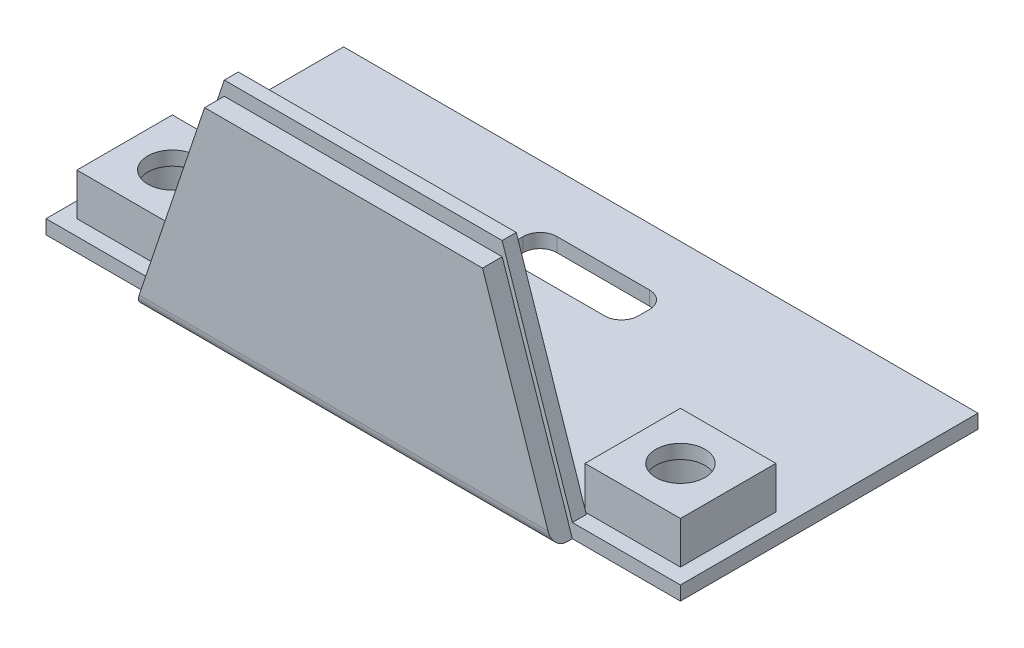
ISO-10303-21;
HEADER;
FILE_DESCRIPTION(('STEP AP214'),'2;1');
FILE_NAME('part.step','',(''),(''),'','','');
FILE_SCHEMA(('AUTOMOTIVE_DESIGN { 1 0 10303 214 1 1 1 1 }'));
ENDSEC;
DATA;
#1=APPLICATION_CONTEXT('core data for automotive mechanical design processes');
#2=APPLICATION_PROTOCOL_DEFINITION('international standard','automotive_design',2000,#1);
#3=PRODUCT_CONTEXT('',#1,'mechanical');
#4=PRODUCT('Part','Part','',(#3));
#5=PRODUCT_RELATED_PRODUCT_CATEGORY('part','',(#4));
#6=PRODUCT_DEFINITION_FORMATION('','',#4);
#7=PRODUCT_DEFINITION_CONTEXT('part definition',#1,'design');
#8=PRODUCT_DEFINITION('design','',#6,#7);
#9=PRODUCT_DEFINITION_SHAPE('','',#8);
#10=(LENGTH_UNIT() NAMED_UNIT(*) SI_UNIT(.MILLI.,.METRE.));
#11=(NAMED_UNIT(*) PLANE_ANGLE_UNIT() SI_UNIT($,.RADIAN.));
#12=(NAMED_UNIT(*) SI_UNIT($,.STERADIAN.) SOLID_ANGLE_UNIT());
#13=UNCERTAINTY_MEASURE_WITH_UNIT(LENGTH_MEASURE(1.E-05),#10,'distance_accuracy_value','');
#14=(GEOMETRIC_REPRESENTATION_CONTEXT(3) GLOBAL_UNCERTAINTY_ASSIGNED_CONTEXT((#13)) GLOBAL_UNIT_ASSIGNED_CONTEXT((#10,
#11,#12)) REPRESENTATION_CONTEXT('',''));
#15=CARTESIAN_POINT('',(0.,0.,0.));
#16=DIRECTION('',(0.,0.,1.));
#17=DIRECTION('',(1.,0.,0.));
#18=AXIS2_PLACEMENT_3D('',#15,#16,#17);
#19=CARTESIAN_POINT('',(0.,1.,0.));
#20=DIRECTION('',(0.,1.,0.));
#21=DIRECTION('',(0.,0.,1.));
#22=AXIS2_PLACEMENT_3D('',#19,#20,#21);
#23=PLANE('',#22);
#24=DIRECTION('',(0.,0.,-1.));
#25=VECTOR('',#24,1.);
#26=CARTESIAN_POINT('',(-4.5,1.,-5.3));
#27=LINE('',#26,#25);
#28=CARTESIAN_POINT('',(-4.5,1.,-4.5));
#29=VERTEX_POINT('',#28);
#30=CARTESIAN_POINT('',(-4.5,1.,-5.3));
#31=VERTEX_POINT('',#30);
#32=EDGE_CURVE('E240',#29,#31,#27,.T.);
#33=ORIENTED_EDGE('',*,*,#32,.T.);
#34=CARTESIAN_POINT('',(-3.3,1.,-5.3));
#35=DIRECTION('',(0.,1.,0.));
#36=DIRECTION('',(0.,0.,1.));
#37=AXIS2_PLACEMENT_3D('',#34,#35,#36);
#38=CIRCLE('',#37,1.2);
#39=CARTESIAN_POINT('',(-3.3,1.,-6.5));
#40=VERTEX_POINT('',#39);
#41=EDGE_CURVE('E226',#31,#40,#38,.F.);
#42=ORIENTED_EDGE('',*,*,#41,.T.);
#43=DIRECTION('',(1.,0.,0.));
#44=VECTOR('',#43,1.);
#45=CARTESIAN_POINT('',(-3.3,1.,-6.5));
#46=LINE('',#45,#44);
#47=CARTESIAN_POINT('',(3.3,1.,-6.5));
#48=VERTEX_POINT('',#47);
#49=EDGE_CURVE('E275',#40,#48,#46,.T.);
#50=ORIENTED_EDGE('',*,*,#49,.T.);
#51=CARTESIAN_POINT('',(3.3,1.,-5.3));
#52=DIRECTION('',(0.,1.,0.));
#53=DIRECTION('',(0.,0.,1.));
#54=AXIS2_PLACEMENT_3D('',#51,#52,#53);
#55=CIRCLE('',#54,1.2);
#56=CARTESIAN_POINT('',(4.5,1.,-5.3));
#57=VERTEX_POINT('',#56);
#58=EDGE_CURVE('E271',#48,#57,#55,.F.);
#59=ORIENTED_EDGE('',*,*,#58,.T.);
#60=DIRECTION('',(0.,0.,1.));
#61=VECTOR('',#60,1.);
#62=CARTESIAN_POINT('',(4.5,1.,-5.3));
#63=LINE('',#62,#61);
#64=CARTESIAN_POINT('',(4.5,1.,-4.5));
#65=VERTEX_POINT('',#64);
#66=EDGE_CURVE('E267',#57,#65,#63,.T.);
#67=ORIENTED_EDGE('',*,*,#66,.T.);
#68=CARTESIAN_POINT('',(3.3,1.,-4.5));
#69=DIRECTION('',(0.,1.,0.));
#70=DIRECTION('',(0.,0.,1.));
#71=AXIS2_PLACEMENT_3D('',#68,#69,#70);
#72=CIRCLE('',#71,1.2);
#73=CARTESIAN_POINT('',(3.3,1.,-3.3));
#74=VERTEX_POINT('',#73);
#75=EDGE_CURVE('E263',#65,#74,#72,.F.);
#76=ORIENTED_EDGE('',*,*,#75,.T.);
#77=DIRECTION('',(-1.,0.,0.));
#78=VECTOR('',#77,1.);
#79=CARTESIAN_POINT('',(-3.3,1.,-3.3));
#80=LINE('',#79,#78);
#81=CARTESIAN_POINT('',(-3.3,1.,-3.3));
#82=VERTEX_POINT('',#81);
#83=EDGE_CURVE('E260',#74,#82,#80,.T.);
#84=ORIENTED_EDGE('',*,*,#83,.T.);
#85=CARTESIAN_POINT('',(-3.3,1.,-4.5));
#86=DIRECTION('',(0.,1.,0.));
#87=DIRECTION('',(0.,0.,1.));
#88=AXIS2_PLACEMENT_3D('',#85,#86,#87);
#89=CIRCLE('',#88,1.2);
#90=EDGE_CURVE('E248',#82,#29,#89,.F.);
#91=ORIENTED_EDGE('',*,*,#90,.T.);
#92=EDGE_LOOP('',(#33,#42,#50,#59,#67,#76,#84,#91));
#93=FACE_BOUND('',#92,.T.);
#94=DIRECTION('',(0.,0.,-1.));
#95=VECTOR('',#94,1.);
#96=CARTESIAN_POINT('',(-21.5,1.,2.7));
#97=LINE('',#96,#95);
#98=CARTESIAN_POINT('',(-21.5,1.,9.5));
#99=VERTEX_POINT('',#98);
#100=CARTESIAN_POINT('',(-21.5,1.,2.7));
#101=VERTEX_POINT('',#100);
#102=EDGE_CURVE('E295',#99,#101,#97,.T.);
#103=ORIENTED_EDGE('',*,*,#102,.T.);
#104=DIRECTION('',(1.,0.,0.));
#105=VECTOR('',#104,1.);
#106=CARTESIAN_POINT('',(-14.7,1.,2.7));
#107=LINE('',#106,#105);
#108=CARTESIAN_POINT('',(-14.7,1.,2.7));
#109=VERTEX_POINT('',#108);
#110=EDGE_CURVE('E300',#101,#109,#107,.T.);
#111=ORIENTED_EDGE('',*,*,#110,.T.);
#112=DIRECTION('',(0.,0.,1.));
#113=VECTOR('',#112,1.);
#114=CARTESIAN_POINT('',(-14.7,1.,2.7));
#115=LINE('',#114,#113);
#116=CARTESIAN_POINT('',(-14.7,1.,9.5));
#117=VERTEX_POINT('',#116);
#118=EDGE_CURVE('E313',#109,#117,#115,.T.);
#119=ORIENTED_EDGE('',*,*,#118,.T.);
#120=DIRECTION('',(-1.,0.,0.));
#121=VECTOR('',#120,1.);
#122=CARTESIAN_POINT('',(-14.7,1.,9.5));
#123=LINE('',#122,#121);
#124=EDGE_CURVE('E311',#117,#99,#123,.T.);
#125=ORIENTED_EDGE('',*,*,#124,.T.);
#126=EDGE_LOOP('',(#103,#111,#119,#125));
#127=FACE_BOUND('',#126,.T.);
#128=DIRECTION('',(-1.,0.,0.));
#129=VECTOR('',#128,1.);
#130=CARTESIAN_POINT('',(14.7,1.,2.7));
#131=LINE('',#130,#129);
#132=CARTESIAN_POINT('',(21.5,1.,2.7));
#133=VERTEX_POINT('',#132);
#134=CARTESIAN_POINT('',(14.7,1.,2.7));
#135=VERTEX_POINT('',#134);
#136=EDGE_CURVE('E351',#133,#135,#131,.T.);
#137=ORIENTED_EDGE('',*,*,#136,.F.);
#138=DIRECTION('',(0.,0.,-1.));
#139=VECTOR('',#138,1.);
#140=CARTESIAN_POINT('',(21.5,1.,2.7));
#141=LINE('',#140,#139);
#142=CARTESIAN_POINT('',(21.5,1.,9.5));
#143=VERTEX_POINT('',#142);
#144=EDGE_CURVE('E337',#143,#133,#141,.T.);
#145=ORIENTED_EDGE('',*,*,#144,.F.);
#146=DIRECTION('',(1.,0.,0.));
#147=VECTOR('',#146,1.);
#148=CARTESIAN_POINT('',(14.7,1.,9.5));
#149=LINE('',#148,#147);
#150=CARTESIAN_POINT('',(14.7,1.,9.5));
#151=VERTEX_POINT('',#150);
#152=EDGE_CURVE('E342',#151,#143,#149,.T.);
#153=ORIENTED_EDGE('',*,*,#152,.F.);
#154=DIRECTION('',(0.,0.,1.));
#155=VECTOR('',#154,1.);
#156=CARTESIAN_POINT('',(14.7,1.,2.7));
#157=LINE('',#156,#155);
#158=EDGE_CURVE('E353',#135,#151,#157,.T.);
#159=ORIENTED_EDGE('',*,*,#158,.F.);
#160=EDGE_LOOP('',(#137,#145,#153,#159));
#161=FACE_BOUND('',#160,.T.);
#162=DIRECTION('',(-1.,0.,0.));
#163=VECTOR('',#162,1.);
#164=CARTESIAN_POINT('',(14.9,1.00000000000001,9.6));
#165=LINE('',#164,#163);
#166=CARTESIAN_POINT('',(14.9,1.00000000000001,9.6));
#167=VERTEX_POINT('',#166);
#168=CARTESIAN_POINT('',(-14.9,1.,9.6));
#169=VERTEX_POINT('',#168);
#170=EDGE_CURVE('E369',#167,#169,#165,.T.);
#171=ORIENTED_EDGE('',*,*,#170,.F.);
#172=DIRECTION('',(0.,0.,1.));
#173=VECTOR('',#172,1.);
#174=CARTESIAN_POINT('',(14.9,1.00000000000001,9.6));
#175=LINE('',#174,#173);
#176=CARTESIAN_POINT('',(14.9,1.00000000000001,10.6));
#177=VERTEX_POINT('',#176);
#178=EDGE_CURVE('E388',#167,#177,#175,.T.);
#179=ORIENTED_EDGE('',*,*,#178,.T.);
#180=DIRECTION('',(1.,0.,0.));
#181=VECTOR('',#180,1.);
#182=CARTESIAN_POINT('',(22.6,1.,10.6));
#183=LINE('',#182,#181);
#184=CARTESIAN_POINT('',(22.6,1.,10.6));
#185=VERTEX_POINT('',#184);
#186=EDGE_CURVE('E422',#177,#185,#183,.T.);
#187=ORIENTED_EDGE('',*,*,#186,.T.);
#188=DIRECTION('',(0.,0.,-1.));
#189=VECTOR('',#188,1.);
#190=CARTESIAN_POINT('',(22.6,1.,10.6));
#191=LINE('',#190,#189);
#192=CARTESIAN_POINT('',(22.6,1.,-10.6));
#193=VERTEX_POINT('',#192);
#194=EDGE_CURVE('E427',#185,#193,#191,.T.);
#195=ORIENTED_EDGE('',*,*,#194,.T.);
#196=DIRECTION('',(-1.,0.,0.));
#197=VECTOR('',#196,1.);
#198=CARTESIAN_POINT('',(22.6,1.,-10.6));
#199=LINE('',#198,#197);
#200=CARTESIAN_POINT('',(-22.6,1.,-10.6));
#201=VERTEX_POINT('',#200);
#202=EDGE_CURVE('E429',#193,#201,#199,.T.);
#203=ORIENTED_EDGE('',*,*,#202,.T.);
#204=DIRECTION('',(0.,0.,1.));
#205=VECTOR('',#204,1.);
#206=CARTESIAN_POINT('',(-22.6,1.,10.6));
#207=LINE('',#206,#205);
#208=CARTESIAN_POINT('',(-22.6,1.,10.6));
#209=VERTEX_POINT('',#208);
#210=EDGE_CURVE('E419',#201,#209,#207,.T.);
#211=ORIENTED_EDGE('',*,*,#210,.T.);
#212=CARTESIAN_POINT('',(-14.9,1.,10.6));
#213=VERTEX_POINT('',#212);
#214=EDGE_CURVE('E424',#209,#213,#183,.T.);
#215=ORIENTED_EDGE('',*,*,#214,.T.);
#216=DIRECTION('',(0.,0.,1.));
#217=VECTOR('',#216,1.);
#218=CARTESIAN_POINT('',(-14.9,1.,9.6));
#219=LINE('',#218,#217);
#220=EDGE_CURVE('E386',#169,#213,#219,.T.);
#221=ORIENTED_EDGE('',*,*,#220,.F.);
#222=EDGE_LOOP('',(#171,#179,#187,#195,#203,#211,#215,#221));
#223=FACE_BOUND('',#222,.T.);
#224=ADVANCED_FACE('F37',(#93,#127,#161,#223),#23,.T.);
#225=CARTESIAN_POINT('',(22.6,1.,10.6));
#226=DIRECTION('',(0.,0.,-1.));
#227=DIRECTION('',(-1.,0.,0.));
#228=AXIS2_PLACEMENT_3D('',#225,#226,#227);
#229=PLANE('',#228);
#230=DIRECTION('',(-0.318135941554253,-0.948045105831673,0.));
#231=VECTOR('',#230,1.);
#232=CARTESIAN_POINT('',(-9.9,14.9,10.6));
#233=LINE('',#232,#231);
#234=CARTESIAN_POINT('',(-9.9,14.9,10.6));
#235=VERTEX_POINT('',#234);
#236=CARTESIAN_POINT('',(-14.9,0.,10.6));
#237=VERTEX_POINT('',#236);
#238=EDGE_CURVE('E404',#235,#237,#233,.T.);
#239=ORIENTED_EDGE('',*,*,#238,.F.);
#240=DIRECTION('',(-1.,0.,0.));
#241=VECTOR('',#240,1.);
#242=CARTESIAN_POINT('',(9.9,14.9,10.6));
#243=LINE('',#242,#241);
#244=CARTESIAN_POINT('',(9.9,14.9,10.6));
#245=VERTEX_POINT('',#244);
#246=EDGE_CURVE('E395',#245,#235,#243,.T.);
#247=ORIENTED_EDGE('',*,*,#246,.F.);
#248=DIRECTION('',(-0.318135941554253,0.948045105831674,0.));
#249=VECTOR('',#248,1.);
#250=CARTESIAN_POINT('',(9.9,14.9,10.6));
#251=LINE('',#250,#249);
#252=CARTESIAN_POINT('',(14.9,0.,10.6));
#253=VERTEX_POINT('',#252);
#254=EDGE_CURVE('E391',#253,#245,#251,.T.);
#255=ORIENTED_EDGE('',*,*,#254,.F.);
#256=DIRECTION('',(1.,0.,0.));
#257=VECTOR('',#256,1.);
#258=CARTESIAN_POINT('',(22.6,0.,10.6));
#259=LINE('',#258,#257);
#260=CARTESIAN_POINT('',(22.6,0.,10.6));
#261=VERTEX_POINT('',#260);
#262=EDGE_CURVE('E434',#253,#261,#259,.T.);
#263=ORIENTED_EDGE('',*,*,#262,.T.);
#264=DIRECTION('',(0.,-1.,0.));
#265=VECTOR('',#264,1.);
#266=CARTESIAN_POINT('',(22.6,1.,10.6));
#267=LINE('',#266,#265);
#268=EDGE_CURVE('E446',#185,#261,#267,.T.);
#269=ORIENTED_EDGE('',*,*,#268,.F.);
#270=ORIENTED_EDGE('',*,*,#186,.F.);
#271=DIRECTION('',(0.318135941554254,-0.948045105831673,0.));
#272=VECTOR('',#271,1.);
#273=CARTESIAN_POINT('',(9.9,15.9,10.6));
#274=LINE('',#273,#272);
#275=CARTESIAN_POINT('',(9.9,15.9,10.6));
#276=VERTEX_POINT('',#275);
#277=EDGE_CURVE('E366',#276,#177,#274,.T.);
#278=ORIENTED_EDGE('',*,*,#277,.F.);
#279=DIRECTION('',(1.,0.,0.));
#280=VECTOR('',#279,1.);
#281=CARTESIAN_POINT('',(9.9,15.9,10.6));
#282=LINE('',#281,#280);
#283=CARTESIAN_POINT('',(-9.9,15.9,10.6));
#284=VERTEX_POINT('',#283);
#285=EDGE_CURVE('E370',#284,#276,#282,.T.);
#286=ORIENTED_EDGE('',*,*,#285,.F.);
#287=DIRECTION('',(0.318135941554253,0.948045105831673,0.));
#288=VECTOR('',#287,1.);
#289=CARTESIAN_POINT('',(-9.9,15.9,10.6));
#290=LINE('',#289,#288);
#291=EDGE_CURVE('E378',#213,#284,#290,.T.);
#292=ORIENTED_EDGE('',*,*,#291,.F.);
#293=ORIENTED_EDGE('',*,*,#214,.F.);
#294=DIRECTION('',(0.,-1.,0.));
#295=VECTOR('',#294,1.);
#296=CARTESIAN_POINT('',(-22.6,1.,10.6));
#297=LINE('',#296,#295);
#298=CARTESIAN_POINT('',(-22.6,0.,10.6));
#299=VERTEX_POINT('',#298);
#300=EDGE_CURVE('E408',#209,#299,#297,.T.);
#301=ORIENTED_EDGE('',*,*,#300,.T.);
#302=EDGE_CURVE('E435',#299,#237,#259,.T.);
#303=ORIENTED_EDGE('',*,*,#302,.T.);
#304=EDGE_LOOP('',(#239,#247,#255,#263,#269,#270,#278,#286,#292,#293,#301,#303));
#305=FACE_BOUND('',#304,.T.);
#306=ADVANCED_FACE('F482',(#305),#229,.F.);
#307=CARTESIAN_POINT('',(-22.6,1.,10.6));
#308=DIRECTION('',(1.,0.,0.));
#309=DIRECTION('',(0.,0.,-1.));
#310=AXIS2_PLACEMENT_3D('',#307,#308,#309);
#311=PLANE('',#310);
#312=DIRECTION('',(0.,0.,1.));
#313=VECTOR('',#312,1.);
#314=CARTESIAN_POINT('',(-22.6,0.,10.6));
#315=LINE('',#314,#313);
#316=CARTESIAN_POINT('',(-22.6,0.,-10.6));
#317=VERTEX_POINT('',#316);
#318=EDGE_CURVE('E418',#317,#299,#315,.T.);
#319=ORIENTED_EDGE('',*,*,#318,.T.);
#320=ORIENTED_EDGE('',*,*,#300,.F.);
#321=ORIENTED_EDGE('',*,*,#210,.F.);
#322=DIRECTION('',(0.,-1.,0.));
#323=VECTOR('',#322,1.);
#324=CARTESIAN_POINT('',(-22.6,1.,-10.6));
#325=LINE('',#324,#323);
#326=EDGE_CURVE('E431',#201,#317,#325,.T.);
#327=ORIENTED_EDGE('',*,*,#326,.T.);
#328=EDGE_LOOP('',(#319,#320,#321,#327));
#329=FACE_BOUND('',#328,.T.);
#330=ADVANCED_FACE('F489',(#329),#311,.F.);
#331=CARTESIAN_POINT('',(22.6,1.,10.6));
#332=DIRECTION('',(-1.,0.,0.));
#333=DIRECTION('',(0.,0.,1.));
#334=AXIS2_PLACEMENT_3D('',#331,#332,#333);
#335=PLANE('',#334);
#336=DIRECTION('',(0.,0.,-1.));
#337=VECTOR('',#336,1.);
#338=CARTESIAN_POINT('',(22.6,0.,10.6));
#339=LINE('',#338,#337);
#340=CARTESIAN_POINT('',(22.6,0.,-10.6));
#341=VERTEX_POINT('',#340);
#342=EDGE_CURVE('E438',#261,#341,#339,.T.);
#343=ORIENTED_EDGE('',*,*,#342,.T.);
#344=DIRECTION('',(0.,-1.,0.));
#345=VECTOR('',#344,1.);
#346=CARTESIAN_POINT('',(22.6,1.,-10.6));
#347=LINE('',#346,#345);
#348=EDGE_CURVE('E443',#193,#341,#347,.T.);
#349=ORIENTED_EDGE('',*,*,#348,.F.);
#350=ORIENTED_EDGE('',*,*,#194,.F.);
#351=ORIENTED_EDGE('',*,*,#268,.T.);
#352=EDGE_LOOP('',(#343,#349,#350,#351));
#353=FACE_BOUND('',#352,.T.);
#354=ADVANCED_FACE('F502',(#353),#335,.F.);
#355=CARTESIAN_POINT('',(22.6,1.,-10.6));
#356=DIRECTION('',(0.,0.,1.));
#357=DIRECTION('',(1.,0.,0.));
#358=AXIS2_PLACEMENT_3D('',#355,#356,#357);
#359=PLANE('',#358);
#360=DIRECTION('',(-1.,0.,0.));
#361=VECTOR('',#360,1.);
#362=CARTESIAN_POINT('',(22.6,0.,-10.6));
#363=LINE('',#362,#361);
#364=EDGE_CURVE('E423',#341,#317,#363,.T.);
#365=ORIENTED_EDGE('',*,*,#364,.T.);
#366=ORIENTED_EDGE('',*,*,#326,.F.);
#367=ORIENTED_EDGE('',*,*,#202,.F.);
#368=ORIENTED_EDGE('',*,*,#348,.T.);
#369=EDGE_LOOP('',(#365,#366,#367,#368));
#370=FACE_BOUND('',#369,.T.);
#371=ADVANCED_FACE('F498',(#370),#359,.F.);
#372=CARTESIAN_POINT('',(0.,0.,0.));
#373=DIRECTION('',(0.,1.,0.));
#374=DIRECTION('',(0.,0.,1.));
#375=AXIS2_PLACEMENT_3D('',#372,#373,#374);
#376=PLANE('',#375);
#377=CARTESIAN_POINT('',(-3.3,0.,-5.3));
#378=DIRECTION('',(0.,-1.,0.));
#379=DIRECTION('',(0.,0.,1.));
#380=AXIS2_PLACEMENT_3D('',#377,#378,#379);
#381=CIRCLE('',#380,1.2);
#382=CARTESIAN_POINT('',(-4.5,0.,-5.3));
#383=VERTEX_POINT('',#382);
#384=CARTESIAN_POINT('',(-3.3,0.,-6.5));
#385=VERTEX_POINT('',#384);
#386=EDGE_CURVE('E996',#383,#385,#381,.T.);
#387=ORIENTED_EDGE('',*,*,#386,.F.);
#388=DIRECTION('',(0.,0.,-1.));
#389=VECTOR('',#388,1.);
#390=CARTESIAN_POINT('',(-4.5,0.,-5.3));
#391=LINE('',#390,#389);
#392=CARTESIAN_POINT('',(-4.5,0.,-4.5));
#393=VERTEX_POINT('',#392);
#394=EDGE_CURVE('E243',#393,#383,#391,.T.);
#395=ORIENTED_EDGE('',*,*,#394,.F.);
#396=CARTESIAN_POINT('',(-3.3,0.,-4.5));
#397=DIRECTION('',(0.,-1.,0.));
#398=DIRECTION('',(0.,0.,1.));
#399=AXIS2_PLACEMENT_3D('',#396,#397,#398);
#400=CIRCLE('',#399,1.2);
#401=CARTESIAN_POINT('',(-3.3,0.,-3.3));
#402=VERTEX_POINT('',#401);
#403=EDGE_CURVE('E255',#402,#393,#400,.T.);
#404=ORIENTED_EDGE('',*,*,#403,.F.);
#405=DIRECTION('',(-1.,0.,0.));
#406=VECTOR('',#405,1.);
#407=CARTESIAN_POINT('',(-3.3,0.,-3.3));
#408=LINE('',#407,#406);
#409=CARTESIAN_POINT('',(3.3,0.,-3.3));
#410=VERTEX_POINT('',#409);
#411=EDGE_CURVE('E249',#410,#402,#408,.T.);
#412=ORIENTED_EDGE('',*,*,#411,.F.);
#413=CARTESIAN_POINT('',(3.3,0.,-4.5));
#414=DIRECTION('',(0.,-1.,0.));
#415=DIRECTION('',(0.,0.,1.));
#416=AXIS2_PLACEMENT_3D('',#413,#414,#415);
#417=CIRCLE('',#416,1.2);
#418=CARTESIAN_POINT('',(4.5,0.,-4.5));
#419=VERTEX_POINT('',#418);
#420=EDGE_CURVE('E251',#419,#410,#417,.T.);
#421=ORIENTED_EDGE('',*,*,#420,.F.);
#422=DIRECTION('',(0.,0.,1.));
#423=VECTOR('',#422,1.);
#424=CARTESIAN_POINT('',(4.5,0.,-5.3));
#425=LINE('',#424,#423);
#426=CARTESIAN_POINT('',(4.5,0.,-5.3));
#427=VERTEX_POINT('',#426);
#428=EDGE_CURVE('E1002',#427,#419,#425,.T.);
#429=ORIENTED_EDGE('',*,*,#428,.F.);
#430=CARTESIAN_POINT('',(3.3,0.,-5.3));
#431=DIRECTION('',(0.,-1.,0.));
#432=DIRECTION('',(0.,0.,-1.));
#433=AXIS2_PLACEMENT_3D('',#430,#431,#432);
#434=CIRCLE('',#433,1.2);
#435=CARTESIAN_POINT('',(3.3,0.,-6.5));
#436=VERTEX_POINT('',#435);
#437=EDGE_CURVE('E1000',#436,#427,#434,.T.);
#438=ORIENTED_EDGE('',*,*,#437,.F.);
#439=DIRECTION('',(1.,0.,0.));
#440=VECTOR('',#439,1.);
#441=CARTESIAN_POINT('',(-3.3,0.,-6.5));
#442=LINE('',#441,#440);
#443=EDGE_CURVE('E994',#385,#436,#442,.T.);
#444=ORIENTED_EDGE('',*,*,#443,.F.);
#445=EDGE_LOOP('',(#387,#395,#404,#412,#421,#429,#438,#444));
#446=FACE_BOUND('',#445,.T.);
#447=CARTESIAN_POINT('',(-18.1,0.,6.1));
#448=DIRECTION('',(0.,1.,0.));
#449=DIRECTION('',(0.,0.,1.));
#450=AXIS2_PLACEMENT_3D('',#447,#448,#449);
#451=CIRCLE('',#450,3.);
#452=CARTESIAN_POINT('',(-18.1,0.,9.09999999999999));
#453=VERTEX_POINT('',#452);
#454=EDGE_CURVE('E285',#453,#453,#451,.T.);
#455=ORIENTED_EDGE('',*,*,#454,.T.);
#456=EDGE_LOOP('',(#455));
#457=FACE_BOUND('',#456,.T.);
#458=CARTESIAN_POINT('',(18.1,0.,6.1));
#459=DIRECTION('',(0.,1.,0.));
#460=DIRECTION('',(0.,0.,1.));
#461=AXIS2_PLACEMENT_3D('',#458,#459,#460);
#462=CIRCLE('',#461,3.);
#463=CARTESIAN_POINT('',(18.1,0.,9.09999999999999));
#464=VERTEX_POINT('',#463);
#465=EDGE_CURVE('E327',#464,#464,#462,.F.);
#466=ORIENTED_EDGE('',*,*,#465,.F.);
#467=EDGE_LOOP('',(#466));
#468=FACE_BOUND('',#467,.T.);
#469=DIRECTION('',(0.,0.,-1.));
#470=VECTOR('',#469,1.);
#471=CARTESIAN_POINT('',(14.9,0.,12.));
#472=LINE('',#471,#470);
#473=CARTESIAN_POINT('',(14.9,0.,11.));
#474=VERTEX_POINT('',#473);
#475=EDGE_CURVE('E400',#474,#253,#472,.T.);
#476=ORIENTED_EDGE('',*,*,#475,.F.);
#477=DIRECTION('',(1.,0.,0.));
#478=VECTOR('',#477,1.);
#479=CARTESIAN_POINT('',(-14.9,0.,11.));
#480=LINE('',#479,#478);
#481=CARTESIAN_POINT('',(-14.9,0.,11.));
#482=VERTEX_POINT('',#481);
#483=EDGE_CURVE('E45',#474,#482,#480,.F.);
#484=ORIENTED_EDGE('',*,*,#483,.T.);
#485=DIRECTION('',(0.,0.,-1.));
#486=VECTOR('',#485,1.);
#487=CARTESIAN_POINT('',(-14.9,0.,12.));
#488=LINE('',#487,#486);
#489=EDGE_CURVE('E410',#482,#237,#488,.T.);
#490=ORIENTED_EDGE('',*,*,#489,.T.);
#491=ORIENTED_EDGE('',*,*,#302,.F.);
#492=ORIENTED_EDGE('',*,*,#318,.F.);
#493=ORIENTED_EDGE('',*,*,#364,.F.);
#494=ORIENTED_EDGE('',*,*,#342,.F.);
#495=ORIENTED_EDGE('',*,*,#262,.F.);
#496=EDGE_LOOP('',(#476,#484,#490,#491,#492,#493,#494,#495));
#497=FACE_BOUND('',#496,.T.);
#498=ADVANCED_FACE('F495',(#446,#457,#468,#497),#376,.F.);
#499=CARTESIAN_POINT('',(9.9,14.9,12.));
#500=DIRECTION('',(-0.948045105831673,-0.318135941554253,0.));
#501=DIRECTION('',(0.318135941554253,-0.948045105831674,0.));
#502=AXIS2_PLACEMENT_3D('',#499,#500,#501);
#503=PLANE('',#502);
#504=DIRECTION('',(-0.318135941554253,0.948045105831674,0.));
#505=VECTOR('',#504,1.);
#506=CARTESIAN_POINT('',(9.9,14.9,12.));
#507=LINE('',#506,#505);
#508=CARTESIAN_POINT('',(14.5644295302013,0.999999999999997,12.));
#509=VERTEX_POINT('',#508);
#510=CARTESIAN_POINT('',(9.9,14.9,12.));
#511=VERTEX_POINT('',#510);
#512=EDGE_CURVE('E392',#509,#511,#507,.T.);
#513=ORIENTED_EDGE('',*,*,#512,.F.);
#514=CARTESIAN_POINT('',(14.5644295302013,1.,11.));
#515=DIRECTION('',(-0.948045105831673,-0.318135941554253,0.));
#516=DIRECTION('',(-0.318135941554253,0.948045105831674,0.));
#517=AXIS2_PLACEMENT_3D('',#514,#515,#516);
#518=ELLIPSE('',#517,1.05480213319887,1.);
#519=EDGE_CURVE('E59',#509,#474,#518,.F.);
#520=ORIENTED_EDGE('',*,*,#519,.T.);
#521=ORIENTED_EDGE('',*,*,#475,.T.);
#522=ORIENTED_EDGE('',*,*,#254,.T.);
#523=DIRECTION('',(0.,0.,-1.));
#524=VECTOR('',#523,1.);
#525=CARTESIAN_POINT('',(9.9,14.9,12.));
#526=LINE('',#525,#524);
#527=EDGE_CURVE('E415',#511,#245,#526,.T.);
#528=ORIENTED_EDGE('',*,*,#527,.F.);
#529=EDGE_LOOP('',(#513,#520,#521,#522,#528));
#530=FACE_BOUND('',#529,.T.);
#531=ADVANCED_FACE('F465',(#530),#503,.F.);
#532=CARTESIAN_POINT('',(9.9,14.9,12.));
#533=DIRECTION('',(0.,-1.,0.));
#534=DIRECTION('',(0.,0.,-1.));
#535=AXIS2_PLACEMENT_3D('',#532,#533,#534);
#536=PLANE('',#535);
#537=ORIENTED_EDGE('',*,*,#246,.T.);
#538=DIRECTION('',(0.,0.,-1.));
#539=VECTOR('',#538,1.);
#540=CARTESIAN_POINT('',(-9.9,14.9,12.));
#541=LINE('',#540,#539);
#542=CARTESIAN_POINT('',(-9.9,14.9,12.));
#543=VERTEX_POINT('',#542);
#544=EDGE_CURVE('E412',#543,#235,#541,.T.);
#545=ORIENTED_EDGE('',*,*,#544,.F.);
#546=DIRECTION('',(-1.,0.,0.));
#547=VECTOR('',#546,1.);
#548=CARTESIAN_POINT('',(9.9,14.9,12.));
#549=LINE('',#548,#547);
#550=EDGE_CURVE('E394',#511,#543,#549,.T.);
#551=ORIENTED_EDGE('',*,*,#550,.F.);
#552=ORIENTED_EDGE('',*,*,#527,.T.);
#553=EDGE_LOOP('',(#537,#545,#551,#552));
#554=FACE_BOUND('',#553,.T.);
#555=ADVANCED_FACE('F469',(#554),#536,.F.);
#556=CARTESIAN_POINT('',(-9.9,14.9,12.));
#557=DIRECTION('',(0.948045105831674,-0.318135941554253,0.));
#558=DIRECTION('',(0.318135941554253,0.948045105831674,0.));
#559=AXIS2_PLACEMENT_3D('',#556,#557,#558);
#560=PLANE('',#559);
#561=ORIENTED_EDGE('',*,*,#489,.F.);
#562=CARTESIAN_POINT('',(-14.5644295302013,1.,11.));
#563=DIRECTION('',(0.948045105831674,-0.318135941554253,0.));
#564=DIRECTION('',(-0.318135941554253,-0.948045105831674,0.));
#565=AXIS2_PLACEMENT_3D('',#562,#563,#564);
#566=ELLIPSE('',#565,1.05480213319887,1.);
#567=CARTESIAN_POINT('',(-14.5644295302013,1.,12.));
#568=VERTEX_POINT('',#567);
#569=EDGE_CURVE('E11',#482,#568,#566,.F.);
#570=ORIENTED_EDGE('',*,*,#569,.T.);
#571=DIRECTION('',(-0.318135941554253,-0.948045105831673,0.));
#572=VECTOR('',#571,1.);
#573=CARTESIAN_POINT('',(-9.9,14.9,12.));
#574=LINE('',#573,#572);
#575=EDGE_CURVE('E397',#543,#568,#574,.T.);
#576=ORIENTED_EDGE('',*,*,#575,.F.);
#577=ORIENTED_EDGE('',*,*,#544,.T.);
#578=ORIENTED_EDGE('',*,*,#238,.T.);
#579=EDGE_LOOP('',(#561,#570,#576,#577,#578));
#580=FACE_BOUND('',#579,.T.);
#581=ADVANCED_FACE('F472',(#580),#560,.F.);
#582=CARTESIAN_POINT('',(0.,0.,12.));
#583=DIRECTION('',(0.,0.,1.));
#584=DIRECTION('',(1.,0.,0.));
#585=AXIS2_PLACEMENT_3D('',#582,#583,#584);
#586=PLANE('',#585);
#587=ORIENTED_EDGE('',*,*,#575,.T.);
#588=DIRECTION('',(1.,0.,0.));
#589=VECTOR('',#588,1.);
#590=CARTESIAN_POINT('',(14.9,1.,12.));
#591=LINE('',#590,#589);
#592=EDGE_CURVE('E407',#568,#509,#591,.T.);
#593=ORIENTED_EDGE('',*,*,#592,.T.);
#594=ORIENTED_EDGE('',*,*,#512,.T.);
#595=ORIENTED_EDGE('',*,*,#550,.T.);
#596=EDGE_LOOP('',(#587,#593,#594,#595));
#597=FACE_BOUND('',#596,.T.);
#598=ADVANCED_FACE('F459',(#597),#586,.T.);
#599=CARTESIAN_POINT('',(9.9,15.9,9.6));
#600=DIRECTION('',(-0.948045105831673,-0.318135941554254,0.));
#601=DIRECTION('',(0.318135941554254,-0.948045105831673,0.));
#602=AXIS2_PLACEMENT_3D('',#599,#600,#601);
#603=PLANE('',#602);
#604=ORIENTED_EDGE('',*,*,#277,.T.);
#605=ORIENTED_EDGE('',*,*,#178,.F.);
#606=DIRECTION('',(0.318135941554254,-0.948045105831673,0.));
#607=VECTOR('',#606,1.);
#608=CARTESIAN_POINT('',(9.9,15.9,9.6));
#609=LINE('',#608,#607);
#610=CARTESIAN_POINT('',(9.9,15.9,9.6));
#611=VERTEX_POINT('',#610);
#612=EDGE_CURVE('E367',#611,#167,#609,.T.);
#613=ORIENTED_EDGE('',*,*,#612,.F.);
#614=DIRECTION('',(0.,0.,1.));
#615=VECTOR('',#614,1.);
#616=CARTESIAN_POINT('',(9.9,15.9,9.6));
#617=LINE('',#616,#615);
#618=EDGE_CURVE('E376',#611,#276,#617,.T.);
#619=ORIENTED_EDGE('',*,*,#618,.T.);
#620=EDGE_LOOP('',(#604,#605,#613,#619));
#621=FACE_BOUND('',#620,.T.);
#622=ADVANCED_FACE('F531',(#621),#603,.F.);
#623=CARTESIAN_POINT('',(-9.9,15.9,9.6));
#624=DIRECTION('',(0.948045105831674,-0.318135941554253,0.));
#625=DIRECTION('',(0.318135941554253,0.948045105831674,0.));
#626=AXIS2_PLACEMENT_3D('',#623,#624,#625);
#627=PLANE('',#626);
#628=ORIENTED_EDGE('',*,*,#291,.T.);
#629=DIRECTION('',(0.,0.,1.));
#630=VECTOR('',#629,1.);
#631=CARTESIAN_POINT('',(-9.9,15.9,9.6));
#632=LINE('',#631,#630);
#633=CARTESIAN_POINT('',(-9.9,15.9,9.6));
#634=VERTEX_POINT('',#633);
#635=EDGE_CURVE('E383',#634,#284,#632,.T.);
#636=ORIENTED_EDGE('',*,*,#635,.F.);
#637=DIRECTION('',(0.318135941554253,0.948045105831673,0.));
#638=VECTOR('',#637,1.);
#639=CARTESIAN_POINT('',(-9.9,15.9,9.6));
#640=LINE('',#639,#638);
#641=EDGE_CURVE('E372',#169,#634,#640,.T.);
#642=ORIENTED_EDGE('',*,*,#641,.F.);
#643=ORIENTED_EDGE('',*,*,#220,.T.);
#644=EDGE_LOOP('',(#628,#636,#642,#643));
#645=FACE_BOUND('',#644,.T.);
#646=ADVANCED_FACE('F539',(#645),#627,.F.);
#647=CARTESIAN_POINT('',(9.9,15.9,9.6));
#648=DIRECTION('',(0.,-1.,0.));
#649=DIRECTION('',(1.,0.,0.));
#650=AXIS2_PLACEMENT_3D('',#647,#648,#649);
#651=PLANE('',#650);
#652=ORIENTED_EDGE('',*,*,#285,.T.);
#653=ORIENTED_EDGE('',*,*,#618,.F.);
#654=DIRECTION('',(1.,0.,0.));
#655=VECTOR('',#654,1.);
#656=CARTESIAN_POINT('',(9.9,15.9,9.6));
#657=LINE('',#656,#655);
#658=EDGE_CURVE('E374',#634,#611,#657,.T.);
#659=ORIENTED_EDGE('',*,*,#658,.F.);
#660=ORIENTED_EDGE('',*,*,#635,.T.);
#661=EDGE_LOOP('',(#652,#653,#659,#660));
#662=FACE_BOUND('',#661,.T.);
#663=ADVANCED_FACE('F535',(#662),#651,.F.);
#664=CARTESIAN_POINT('',(0.,0.,9.59999999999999));
#665=DIRECTION('',(0.,0.,-1.));
#666=DIRECTION('',(-1.,0.,0.));
#667=AXIS2_PLACEMENT_3D('',#664,#665,#666);
#668=PLANE('',#667);
#669=ORIENTED_EDGE('',*,*,#612,.T.);
#670=ORIENTED_EDGE('',*,*,#170,.T.);
#671=ORIENTED_EDGE('',*,*,#641,.T.);
#672=ORIENTED_EDGE('',*,*,#658,.T.);
#673=EDGE_LOOP('',(#669,#670,#671,#672));
#674=FACE_BOUND('',#673,.T.);
#675=ADVANCED_FACE('F541',(#674),#668,.T.);
#676=CARTESIAN_POINT('',(0.,4.,0.));
#677=DIRECTION('',(0.,1.,0.));
#678=DIRECTION('',(0.,0.,1.));
#679=AXIS2_PLACEMENT_3D('',#676,#677,#678);
#680=PLANE('',#679);
#681=DIRECTION('',(0.,0.,-1.));
#682=VECTOR('',#681,1.);
#683=CARTESIAN_POINT('',(21.5,4.,2.7));
#684=LINE('',#683,#682);
#685=CARTESIAN_POINT('',(21.5,4.,9.5));
#686=VERTEX_POINT('',#685);
#687=CARTESIAN_POINT('',(21.5,4.,2.7));
#688=VERTEX_POINT('',#687);
#689=EDGE_CURVE('E338',#686,#688,#684,.T.);
#690=ORIENTED_EDGE('',*,*,#689,.T.);
#691=DIRECTION('',(-1.,0.,0.));
#692=VECTOR('',#691,1.);
#693=CARTESIAN_POINT('',(14.7,4.,2.7));
#694=LINE('',#693,#692);
#695=CARTESIAN_POINT('',(14.7,4.,2.7));
#696=VERTEX_POINT('',#695);
#697=EDGE_CURVE('E341',#688,#696,#694,.T.);
#698=ORIENTED_EDGE('',*,*,#697,.T.);
#699=DIRECTION('',(0.,0.,1.));
#700=VECTOR('',#699,1.);
#701=CARTESIAN_POINT('',(14.7,4.,2.7));
#702=LINE('',#701,#700);
#703=CARTESIAN_POINT('',(14.7,4.,9.5));
#704=VERTEX_POINT('',#703);
#705=EDGE_CURVE('E344',#696,#704,#702,.T.);
#706=ORIENTED_EDGE('',*,*,#705,.T.);
#707=DIRECTION('',(1.,0.,0.));
#708=VECTOR('',#707,1.);
#709=CARTESIAN_POINT('',(14.7,4.,9.5));
#710=LINE('',#709,#708);
#711=EDGE_CURVE('E346',#704,#686,#710,.T.);
#712=ORIENTED_EDGE('',*,*,#711,.T.);
#713=EDGE_LOOP('',(#690,#698,#706,#712));
#714=FACE_BOUND('',#713,.T.);
#715=CARTESIAN_POINT('',(18.1,4.,6.1));
#716=DIRECTION('',(0.,1.,0.));
#717=DIRECTION('',(0.,0.,1.));
#718=AXIS2_PLACEMENT_3D('',#715,#716,#717);
#719=CIRCLE('',#718,1.75);
#720=CARTESIAN_POINT('',(18.1,4.,7.85));
#721=VERTEX_POINT('',#720);
#722=EDGE_CURVE('E334',#721,#721,#719,.T.);
#723=ORIENTED_EDGE('',*,*,#722,.F.);
#724=EDGE_LOOP('',(#723));
#725=FACE_BOUND('',#724,.T.);
#726=ADVANCED_FACE('F543',(#714,#725),#680,.T.);
#727=CARTESIAN_POINT('',(21.5,4.,2.7));
#728=DIRECTION('',(-1.,0.,0.));
#729=DIRECTION('',(0.,0.,1.));
#730=AXIS2_PLACEMENT_3D('',#727,#728,#729);
#731=PLANE('',#730);
#732=ORIENTED_EDGE('',*,*,#144,.T.);
#733=DIRECTION('',(0.,-1.,0.));
#734=VECTOR('',#733,1.);
#735=CARTESIAN_POINT('',(21.5,4.,2.7));
#736=LINE('',#735,#734);
#737=EDGE_CURVE('E364',#688,#133,#736,.T.);
#738=ORIENTED_EDGE('',*,*,#737,.F.);
#739=ORIENTED_EDGE('',*,*,#689,.F.);
#740=DIRECTION('',(0.,-1.,0.));
#741=VECTOR('',#740,1.);
#742=CARTESIAN_POINT('',(21.5,4.,9.5));
#743=LINE('',#742,#741);
#744=EDGE_CURVE('E348',#686,#143,#743,.T.);
#745=ORIENTED_EDGE('',*,*,#744,.T.);
#746=EDGE_LOOP('',(#732,#738,#739,#745));
#747=FACE_BOUND('',#746,.T.);
#748=ADVANCED_FACE('F549',(#747),#731,.F.);
#749=CARTESIAN_POINT('',(14.7,4.,2.7));
#750=DIRECTION('',(0.,0.,1.));
#751=DIRECTION('',(1.,0.,0.));
#752=AXIS2_PLACEMENT_3D('',#749,#750,#751);
#753=PLANE('',#752);
#754=ORIENTED_EDGE('',*,*,#136,.T.);
#755=DIRECTION('',(0.,-1.,0.));
#756=VECTOR('',#755,1.);
#757=CARTESIAN_POINT('',(14.7,4.,2.7));
#758=LINE('',#757,#756);
#759=EDGE_CURVE('E361',#696,#135,#758,.T.);
#760=ORIENTED_EDGE('',*,*,#759,.F.);
#761=ORIENTED_EDGE('',*,*,#697,.F.);
#762=ORIENTED_EDGE('',*,*,#737,.T.);
#763=EDGE_LOOP('',(#754,#760,#761,#762));
#764=FACE_BOUND('',#763,.T.);
#765=ADVANCED_FACE('F804',(#764),#753,.F.);
#766=CARTESIAN_POINT('',(14.7,4.,2.7));
#767=DIRECTION('',(1.,0.,0.));
#768=DIRECTION('',(0.,0.,-1.));
#769=AXIS2_PLACEMENT_3D('',#766,#767,#768);
#770=PLANE('',#769);
#771=ORIENTED_EDGE('',*,*,#158,.T.);
#772=DIRECTION('',(0.,-1.,0.));
#773=VECTOR('',#772,1.);
#774=CARTESIAN_POINT('',(14.7,4.,9.5));
#775=LINE('',#774,#773);
#776=EDGE_CURVE('E359',#704,#151,#775,.T.);
#777=ORIENTED_EDGE('',*,*,#776,.F.);
#778=ORIENTED_EDGE('',*,*,#705,.F.);
#779=ORIENTED_EDGE('',*,*,#759,.T.);
#780=EDGE_LOOP('',(#771,#777,#778,#779));
#781=FACE_BOUND('',#780,.T.);
#782=ADVANCED_FACE('F793',(#781),#770,.F.);
#783=CARTESIAN_POINT('',(14.7,4.,9.5));
#784=DIRECTION('',(0.,0.,-1.));
#785=DIRECTION('',(-1.,0.,0.));
#786=AXIS2_PLACEMENT_3D('',#783,#784,#785);
#787=PLANE('',#786);
#788=ORIENTED_EDGE('',*,*,#152,.T.);
#789=ORIENTED_EDGE('',*,*,#744,.F.);
#790=ORIENTED_EDGE('',*,*,#711,.F.);
#791=ORIENTED_EDGE('',*,*,#776,.T.);
#792=EDGE_LOOP('',(#788,#789,#790,#791));
#793=FACE_BOUND('',#792,.T.);
#794=ADVANCED_FACE('F782',(#793),#787,.F.);
#795=CARTESIAN_POINT('',(18.1,4.,6.1));
#796=DIRECTION('',(0.,-1.,0.));
#797=DIRECTION('',(0.,0.,-1.));
#798=AXIS2_PLACEMENT_3D('',#795,#796,#797);
#799=CYLINDRICAL_SURFACE('',#798,1.75);
#800=CARTESIAN_POINT('',(18.1,3.,6.1));
#801=DIRECTION('',(0.,1.,0.));
#802=DIRECTION('',(0.,0.,1.));
#803=AXIS2_PLACEMENT_3D('',#800,#801,#802);
#804=CIRCLE('',#803,1.75);
#805=CARTESIAN_POINT('',(18.1,3.,7.85));
#806=VERTEX_POINT('',#805);
#807=EDGE_CURVE('E333',#806,#806,#804,.T.);
#808=ORIENTED_EDGE('',*,*,#807,.F.);
#809=EDGE_LOOP('',(#808));
#810=FACE_BOUND('',#809,.T.);
#811=ORIENTED_EDGE('',*,*,#722,.T.);
#812=EDGE_LOOP('',(#811));
#813=FACE_BOUND('',#812,.T.);
#814=ADVANCED_FACE('F771',(#810,#813),#799,.F.);
#815=CARTESIAN_POINT('',(18.1,3.,6.1));
#816=DIRECTION('',(0.,-1.,0.));
#817=DIRECTION('',(0.,0.,-1.));
#818=AXIS2_PLACEMENT_3D('',#815,#816,#817);
#819=CYLINDRICAL_SURFACE('',#818,3.);
#820=CARTESIAN_POINT('',(18.1,3.,6.1));
#821=DIRECTION('',(0.,1.,0.));
#822=DIRECTION('',(0.,0.,1.));
#823=AXIS2_PLACEMENT_3D('',#820,#821,#822);
#824=CIRCLE('',#823,3.);
#825=CARTESIAN_POINT('',(18.1,3.,9.09999999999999));
#826=VERTEX_POINT('',#825);
#827=EDGE_CURVE('E330',#826,#826,#824,.T.);
#828=ORIENTED_EDGE('',*,*,#827,.T.);
#829=EDGE_LOOP('',(#828));
#830=FACE_BOUND('',#829,.T.);
#831=ORIENTED_EDGE('',*,*,#465,.T.);
#832=EDGE_LOOP('',(#831));
#833=FACE_BOUND('',#832,.T.);
#834=ADVANCED_FACE('F760',(#830,#833),#819,.F.);
#835=CARTESIAN_POINT('',(18.1,3.,6.1));
#836=DIRECTION('',(0.,1.,0.));
#837=DIRECTION('',(0.,0.,1.));
#838=AXIS2_PLACEMENT_3D('',#835,#836,#837);
#839=PLANE('',#838);
#840=ORIENTED_EDGE('',*,*,#807,.T.);
#841=EDGE_LOOP('',(#840));
#842=FACE_BOUND('',#841,.T.);
#843=ORIENTED_EDGE('',*,*,#827,.F.);
#844=EDGE_LOOP('',(#843));
#845=FACE_BOUND('',#844,.T.);
#846=ADVANCED_FACE('F749',(#842,#845),#839,.F.);
#847=CARTESIAN_POINT('',(-21.5,4.,2.7));
#848=DIRECTION('',(-1.,0.,0.));
#849=DIRECTION('',(0.,0.,1.));
#850=AXIS2_PLACEMENT_3D('',#847,#848,#849);
#851=PLANE('',#850);
#852=ORIENTED_EDGE('',*,*,#102,.F.);
#853=DIRECTION('',(0.,-1.,0.));
#854=VECTOR('',#853,1.);
#855=CARTESIAN_POINT('',(-21.5,4.,9.5));
#856=LINE('',#855,#854);
#857=CARTESIAN_POINT('',(-21.5,4.,9.5));
#858=VERTEX_POINT('',#857);
#859=EDGE_CURVE('E324',#858,#99,#856,.T.);
#860=ORIENTED_EDGE('',*,*,#859,.F.);
#861=DIRECTION('',(0.,0.,-1.));
#862=VECTOR('',#861,1.);
#863=CARTESIAN_POINT('',(-21.5,4.,2.7));
#864=LINE('',#863,#862);
#865=CARTESIAN_POINT('',(-21.5,4.,2.7));
#866=VERTEX_POINT('',#865);
#867=EDGE_CURVE('E296',#858,#866,#864,.T.);
#868=ORIENTED_EDGE('',*,*,#867,.T.);
#869=DIRECTION('',(0.,-1.,0.));
#870=VECTOR('',#869,1.);
#871=CARTESIAN_POINT('',(-21.5,4.,2.7));
#872=LINE('',#871,#870);
#873=EDGE_CURVE('E309',#866,#101,#872,.T.);
#874=ORIENTED_EDGE('',*,*,#873,.T.);
#875=EDGE_LOOP('',(#852,#860,#868,#874));
#876=FACE_BOUND('',#875,.T.);
#877=ADVANCED_FACE('F738',(#876),#851,.T.);
#878=CARTESIAN_POINT('',(-14.7,4.,9.5));
#879=DIRECTION('',(0.,0.,1.));
#880=DIRECTION('',(1.,0.,0.));
#881=AXIS2_PLACEMENT_3D('',#878,#879,#880);
#882=PLANE('',#881);
#883=ORIENTED_EDGE('',*,*,#124,.F.);
#884=DIRECTION('',(0.,-1.,0.));
#885=VECTOR('',#884,1.);
#886=CARTESIAN_POINT('',(-14.7,4.,9.5));
#887=LINE('',#886,#885);
#888=CARTESIAN_POINT('',(-14.7,4.,9.5));
#889=VERTEX_POINT('',#888);
#890=EDGE_CURVE('E321',#889,#117,#887,.T.);
#891=ORIENTED_EDGE('',*,*,#890,.F.);
#892=DIRECTION('',(-1.,0.,0.));
#893=VECTOR('',#892,1.);
#894=CARTESIAN_POINT('',(-14.7,4.,9.5));
#895=LINE('',#894,#893);
#896=EDGE_CURVE('E299',#889,#858,#895,.T.);
#897=ORIENTED_EDGE('',*,*,#896,.T.);
#898=ORIENTED_EDGE('',*,*,#859,.T.);
#899=EDGE_LOOP('',(#883,#891,#897,#898));
#900=FACE_BOUND('',#899,.T.);
#901=ADVANCED_FACE('F727',(#900),#882,.T.);
#902=CARTESIAN_POINT('',(-14.7,4.,2.7));
#903=DIRECTION('',(1.,0.,0.));
#904=DIRECTION('',(0.,0.,-1.));
#905=AXIS2_PLACEMENT_3D('',#902,#903,#904);
#906=PLANE('',#905);
#907=ORIENTED_EDGE('',*,*,#118,.F.);
#908=DIRECTION('',(0.,-1.,0.));
#909=VECTOR('',#908,1.);
#910=CARTESIAN_POINT('',(-14.7,4.,2.7));
#911=LINE('',#910,#909);
#912=CARTESIAN_POINT('',(-14.7,4.,2.7));
#913=VERTEX_POINT('',#912);
#914=EDGE_CURVE('E318',#913,#109,#911,.T.);
#915=ORIENTED_EDGE('',*,*,#914,.F.);
#916=DIRECTION('',(0.,0.,1.));
#917=VECTOR('',#916,1.);
#918=CARTESIAN_POINT('',(-14.7,4.,2.7));
#919=LINE('',#918,#917);
#920=EDGE_CURVE('E303',#913,#889,#919,.T.);
#921=ORIENTED_EDGE('',*,*,#920,.T.);
#922=ORIENTED_EDGE('',*,*,#890,.T.);
#923=EDGE_LOOP('',(#907,#915,#921,#922));
#924=FACE_BOUND('',#923,.T.);
#925=ADVANCED_FACE('F716',(#924),#906,.T.);
#926=CARTESIAN_POINT('',(-14.7,4.,2.7));
#927=DIRECTION('',(0.,0.,-1.));
#928=DIRECTION('',(-1.,0.,0.));
#929=AXIS2_PLACEMENT_3D('',#926,#927,#928);
#930=PLANE('',#929);
#931=ORIENTED_EDGE('',*,*,#110,.F.);
#932=ORIENTED_EDGE('',*,*,#873,.F.);
#933=DIRECTION('',(1.,0.,0.));
#934=VECTOR('',#933,1.);
#935=CARTESIAN_POINT('',(-14.7,4.,2.7));
#936=LINE('',#935,#934);
#937=EDGE_CURVE('E306',#866,#913,#936,.T.);
#938=ORIENTED_EDGE('',*,*,#937,.T.);
#939=ORIENTED_EDGE('',*,*,#914,.T.);
#940=EDGE_LOOP('',(#931,#932,#938,#939));
#941=FACE_BOUND('',#940,.T.);
#942=ADVANCED_FACE('F705',(#941),#930,.T.);
#943=CARTESIAN_POINT('',(0.,4.,0.));
#944=DIRECTION('',(0.,1.,0.));
#945=DIRECTION('',(0.,0.,1.));
#946=AXIS2_PLACEMENT_3D('',#943,#944,#945);
#947=PLANE('',#946);
#948=CARTESIAN_POINT('',(-18.1,4.,6.1));
#949=DIRECTION('',(0.,-1.,0.));
#950=DIRECTION('',(0.,0.,1.));
#951=AXIS2_PLACEMENT_3D('',#948,#949,#950);
#952=CIRCLE('',#951,1.75);
#953=CARTESIAN_POINT('',(-18.1,4.,7.85));
#954=VERTEX_POINT('',#953);
#955=EDGE_CURVE('E292',#954,#954,#952,.T.);
#956=ORIENTED_EDGE('',*,*,#955,.T.);
#957=EDGE_LOOP('',(#956));
#958=FACE_BOUND('',#957,.T.);
#959=ORIENTED_EDGE('',*,*,#867,.F.);
#960=ORIENTED_EDGE('',*,*,#896,.F.);
#961=ORIENTED_EDGE('',*,*,#920,.F.);
#962=ORIENTED_EDGE('',*,*,#937,.F.);
#963=EDGE_LOOP('',(#959,#960,#961,#962));
#964=FACE_BOUND('',#963,.T.);
#965=ADVANCED_FACE('F694',(#958,#964),#947,.T.);
#966=CARTESIAN_POINT('',(-18.1,4.,6.1));
#967=DIRECTION('',(0.,-1.,0.));
#968=DIRECTION('',(0.,0.,-1.));
#969=AXIS2_PLACEMENT_3D('',#966,#967,#968);
#970=CYLINDRICAL_SURFACE('',#969,1.75);
#971=CARTESIAN_POINT('',(-18.1,3.,6.1));
#972=DIRECTION('',(0.,1.,0.));
#973=DIRECTION('',(0.,0.,1.));
#974=AXIS2_PLACEMENT_3D('',#971,#972,#973);
#975=CIRCLE('',#974,1.75);
#976=CARTESIAN_POINT('',(-18.1,3.,7.85));
#977=VERTEX_POINT('',#976);
#978=EDGE_CURVE('E291',#977,#977,#975,.F.);
#979=ORIENTED_EDGE('',*,*,#978,.T.);
#980=EDGE_LOOP('',(#979));
#981=FACE_BOUND('',#980,.T.);
#982=ORIENTED_EDGE('',*,*,#955,.F.);
#983=EDGE_LOOP('',(#982));
#984=FACE_BOUND('',#983,.T.);
#985=ADVANCED_FACE('F683',(#981,#984),#970,.F.);
#986=CARTESIAN_POINT('',(-18.1,3.,6.1));
#987=DIRECTION('',(0.,1.,0.));
#988=DIRECTION('',(0.,0.,1.));
#989=AXIS2_PLACEMENT_3D('',#986,#987,#988);
#990=PLANE('',#989);
#991=CARTESIAN_POINT('',(-18.1,3.,6.1));
#992=DIRECTION('',(0.,-1.,0.));
#993=DIRECTION('',(0.,0.,1.));
#994=AXIS2_PLACEMENT_3D('',#991,#992,#993);
#995=CIRCLE('',#994,3.);
#996=CARTESIAN_POINT('',(-18.1,3.,9.09999999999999));
#997=VERTEX_POINT('',#996);
#998=EDGE_CURVE('E288',#997,#997,#995,.T.);
#999=ORIENTED_EDGE('',*,*,#998,.T.);
#1000=EDGE_LOOP('',(#999));
#1001=FACE_BOUND('',#1000,.T.);
#1002=ORIENTED_EDGE('',*,*,#978,.F.);
#1003=EDGE_LOOP('',(#1002));
#1004=FACE_BOUND('',#1003,.T.);
#1005=ADVANCED_FACE('F672',(#1001,#1004),#990,.F.);
#1006=CARTESIAN_POINT('',(-18.1,3.,6.1));
#1007=DIRECTION('',(0.,-1.,0.));
#1008=DIRECTION('',(0.,0.,-1.));
#1009=AXIS2_PLACEMENT_3D('',#1006,#1007,#1008);
#1010=CYLINDRICAL_SURFACE('',#1009,3.);
#1011=ORIENTED_EDGE('',*,*,#998,.F.);
#1012=EDGE_LOOP('',(#1011));
#1013=FACE_BOUND('',#1012,.T.);
#1014=ORIENTED_EDGE('',*,*,#454,.F.);
#1015=EDGE_LOOP('',(#1014));
#1016=FACE_BOUND('',#1015,.T.);
#1017=ADVANCED_FACE('F663',(#1013,#1016),#1010,.F.);
#1018=CARTESIAN_POINT('',(-4.5,10.5519631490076,-5.3));
#1019=DIRECTION('',(-1.,0.,0.));
#1020=DIRECTION('',(0.,0.,1.));
#1021=AXIS2_PLACEMENT_3D('',#1018,#1019,#1020);
#1022=PLANE('',#1021);
#1023=DIRECTION('',(0.,-1.,0.));
#1024=VECTOR('',#1023,1.);
#1025=CARTESIAN_POINT('',(-4.5,10.5519631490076,-4.5));
#1026=LINE('',#1025,#1024);
#1027=EDGE_CURVE('E258',#29,#393,#1026,.T.);
#1028=ORIENTED_EDGE('',*,*,#1027,.T.);
#1029=ORIENTED_EDGE('',*,*,#394,.T.);
#1030=DIRECTION('',(0.,-1.,0.));
#1031=VECTOR('',#1030,1.);
#1032=CARTESIAN_POINT('',(-4.5,10.5519631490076,-5.3));
#1033=LINE('',#1032,#1031);
#1034=EDGE_CURVE('E230',#31,#383,#1033,.T.);
#1035=ORIENTED_EDGE('',*,*,#1034,.F.);
#1036=ORIENTED_EDGE('',*,*,#32,.F.);
#1037=EDGE_LOOP('',(#1028,#1029,#1035,#1036));
#1038=FACE_BOUND('',#1037,.T.);
#1039=ADVANCED_FACE('F239',(#1038),#1022,.F.);
#1040=CARTESIAN_POINT('',(-3.3,10.5519631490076,-5.3));
#1041=DIRECTION('',(0.,-1.,0.));
#1042=DIRECTION('',(0.,0.,-1.));
#1043=AXIS2_PLACEMENT_3D('',#1040,#1041,#1042);
#1044=CYLINDRICAL_SURFACE('',#1043,1.2);
#1045=ORIENTED_EDGE('',*,*,#1034,.T.);
#1046=ORIENTED_EDGE('',*,*,#386,.T.);
#1047=DIRECTION('',(0.,-1.,0.));
#1048=VECTOR('',#1047,1.);
#1049=CARTESIAN_POINT('',(-3.3,10.5519631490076,-6.5));
#1050=LINE('',#1049,#1048);
#1051=EDGE_CURVE('E232',#40,#385,#1050,.T.);
#1052=ORIENTED_EDGE('',*,*,#1051,.F.);
#1053=ORIENTED_EDGE('',*,*,#41,.F.);
#1054=EDGE_LOOP('',(#1045,#1046,#1052,#1053));
#1055=FACE_BOUND('',#1054,.T.);
#1056=ADVANCED_FACE('F228',(#1055),#1044,.F.);
#1057=CARTESIAN_POINT('',(-3.3,10.5519631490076,-6.5));
#1058=DIRECTION('',(0.,0.,-1.));
#1059=DIRECTION('',(-1.,0.,0.));
#1060=AXIS2_PLACEMENT_3D('',#1057,#1058,#1059);
#1061=PLANE('',#1060);
#1062=ORIENTED_EDGE('',*,*,#1051,.T.);
#1063=ORIENTED_EDGE('',*,*,#443,.T.);
#1064=DIRECTION('',(0.,-1.,0.));
#1065=VECTOR('',#1064,1.);
#1066=CARTESIAN_POINT('',(3.3,10.5519631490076,-6.5));
#1067=LINE('',#1066,#1065);
#1068=EDGE_CURVE('E274',#48,#436,#1067,.T.);
#1069=ORIENTED_EDGE('',*,*,#1068,.F.);
#1070=ORIENTED_EDGE('',*,*,#49,.F.);
#1071=EDGE_LOOP('',(#1062,#1063,#1069,#1070));
#1072=FACE_BOUND('',#1071,.T.);
#1073=ADVANCED_FACE('F634',(#1072),#1061,.F.);
#1074=CARTESIAN_POINT('',(3.3,10.5519631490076,-5.3));
#1075=DIRECTION('',(0.,-1.,0.));
#1076=DIRECTION('',(0.,0.,-1.));
#1077=AXIS2_PLACEMENT_3D('',#1074,#1075,#1076);
#1078=CYLINDRICAL_SURFACE('',#1077,1.2);
#1079=ORIENTED_EDGE('',*,*,#1068,.T.);
#1080=ORIENTED_EDGE('',*,*,#437,.T.);
#1081=DIRECTION('',(0.,-1.,0.));
#1082=VECTOR('',#1081,1.);
#1083=CARTESIAN_POINT('',(4.5,10.5519631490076,-5.3));
#1084=LINE('',#1083,#1082);
#1085=EDGE_CURVE('E270',#57,#427,#1084,.T.);
#1086=ORIENTED_EDGE('',*,*,#1085,.F.);
#1087=ORIENTED_EDGE('',*,*,#58,.F.);
#1088=EDGE_LOOP('',(#1079,#1080,#1086,#1087));
#1089=FACE_BOUND('',#1088,.T.);
#1090=ADVANCED_FACE('F623',(#1089),#1078,.F.);
#1091=CARTESIAN_POINT('',(4.5,10.5519631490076,-5.3));
#1092=DIRECTION('',(1.,0.,0.));
#1093=DIRECTION('',(0.,0.,-1.));
#1094=AXIS2_PLACEMENT_3D('',#1091,#1092,#1093);
#1095=PLANE('',#1094);
#1096=ORIENTED_EDGE('',*,*,#1085,.T.);
#1097=ORIENTED_EDGE('',*,*,#428,.T.);
#1098=DIRECTION('',(0.,-1.,0.));
#1099=VECTOR('',#1098,1.);
#1100=CARTESIAN_POINT('',(4.5,10.5519631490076,-4.5));
#1101=LINE('',#1100,#1099);
#1102=EDGE_CURVE('E266',#65,#419,#1101,.T.);
#1103=ORIENTED_EDGE('',*,*,#1102,.F.);
#1104=ORIENTED_EDGE('',*,*,#66,.F.);
#1105=EDGE_LOOP('',(#1096,#1097,#1103,#1104));
#1106=FACE_BOUND('',#1105,.T.);
#1107=ADVANCED_FACE('F612',(#1106),#1095,.F.);
#1108=CARTESIAN_POINT('',(3.3,10.5519631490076,-4.5));
#1109=DIRECTION('',(0.,-1.,0.));
#1110=DIRECTION('',(0.,0.,-1.));
#1111=AXIS2_PLACEMENT_3D('',#1108,#1109,#1110);
#1112=CYLINDRICAL_SURFACE('',#1111,1.2);
#1113=ORIENTED_EDGE('',*,*,#1102,.T.);
#1114=ORIENTED_EDGE('',*,*,#420,.T.);
#1115=DIRECTION('',(0.,-1.,0.));
#1116=VECTOR('',#1115,1.);
#1117=CARTESIAN_POINT('',(3.3,10.5519631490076,-3.3));
#1118=LINE('',#1117,#1116);
#1119=EDGE_CURVE('E262',#74,#410,#1118,.T.);
#1120=ORIENTED_EDGE('',*,*,#1119,.F.);
#1121=ORIENTED_EDGE('',*,*,#75,.F.);
#1122=EDGE_LOOP('',(#1113,#1114,#1120,#1121));
#1123=FACE_BOUND('',#1122,.T.);
#1124=ADVANCED_FACE('F601',(#1123),#1112,.F.);
#1125=CARTESIAN_POINT('',(-3.3,10.5519631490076,-3.3));
#1126=DIRECTION('',(0.,0.,1.));
#1127=DIRECTION('',(1.,0.,0.));
#1128=AXIS2_PLACEMENT_3D('',#1125,#1126,#1127);
#1129=PLANE('',#1128);
#1130=ORIENTED_EDGE('',*,*,#1119,.T.);
#1131=ORIENTED_EDGE('',*,*,#411,.T.);
#1132=DIRECTION('',(0.,-1.,0.));
#1133=VECTOR('',#1132,1.);
#1134=CARTESIAN_POINT('',(-3.3,10.5519631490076,-3.3));
#1135=LINE('',#1134,#1133);
#1136=EDGE_CURVE('E259',#82,#402,#1135,.T.);
#1137=ORIENTED_EDGE('',*,*,#1136,.F.);
#1138=ORIENTED_EDGE('',*,*,#83,.F.);
#1139=EDGE_LOOP('',(#1130,#1131,#1137,#1138));
#1140=FACE_BOUND('',#1139,.T.);
#1141=ADVANCED_FACE('F478',(#1140),#1129,.F.);
#1142=CARTESIAN_POINT('',(-3.3,10.5519631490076,-4.5));
#1143=DIRECTION('',(0.,-1.,0.));
#1144=DIRECTION('',(0.,0.,-1.));
#1145=AXIS2_PLACEMENT_3D('',#1142,#1143,#1144);
#1146=CYLINDRICAL_SURFACE('',#1145,1.2);
#1147=ORIENTED_EDGE('',*,*,#1136,.T.);
#1148=ORIENTED_EDGE('',*,*,#403,.T.);
#1149=ORIENTED_EDGE('',*,*,#1027,.F.);
#1150=ORIENTED_EDGE('',*,*,#90,.F.);
#1151=EDGE_LOOP('',(#1147,#1148,#1149,#1150));
#1152=FACE_BOUND('',#1151,.T.);
#1153=ADVANCED_FACE('F474',(#1152),#1146,.F.);
#1154=CARTESIAN_POINT('',(0.,1.,11.));
#1155=DIRECTION('',(-1.,0.,0.));
#1156=DIRECTION('',(0.,0.,1.));
#1157=AXIS2_PLACEMENT_3D('',#1154,#1155,#1156);
#1158=CYLINDRICAL_SURFACE('',#1157,1.);
#1159=ORIENTED_EDGE('',*,*,#569,.F.);
#1160=ORIENTED_EDGE('',*,*,#483,.F.);
#1161=ORIENTED_EDGE('',*,*,#519,.F.);
#1162=ORIENTED_EDGE('',*,*,#592,.F.);
#1163=EDGE_LOOP('',(#1159,#1160,#1161,#1162));
#1164=FACE_BOUND('',#1163,.T.);
#1165=ADVANCED_FACE('F39',(#1164),#1158,.T.);
#1166=CLOSED_SHELL('',(#224,#306,#330,#354,#371,#498,#531,#555,#581,#598,#622,#646,#663,#675,
#726,#748,#765,#782,#794,#814,#834,#846,#877,#901,#925,#942,#965,#985,#1005,#1017,#1039,#1056,
#1073,#1090,#1107,#1124,#1141,#1153,#1165));
#1167=MANIFOLD_SOLID_BREP('B2',#1166);
#1168=ADVANCED_BREP_SHAPE_REPRESENTATION('',(#18,#1167),#14);
#1169=SHAPE_DEFINITION_REPRESENTATION(#9,#1168);
ENDSEC;
END-ISO-10303-21;
